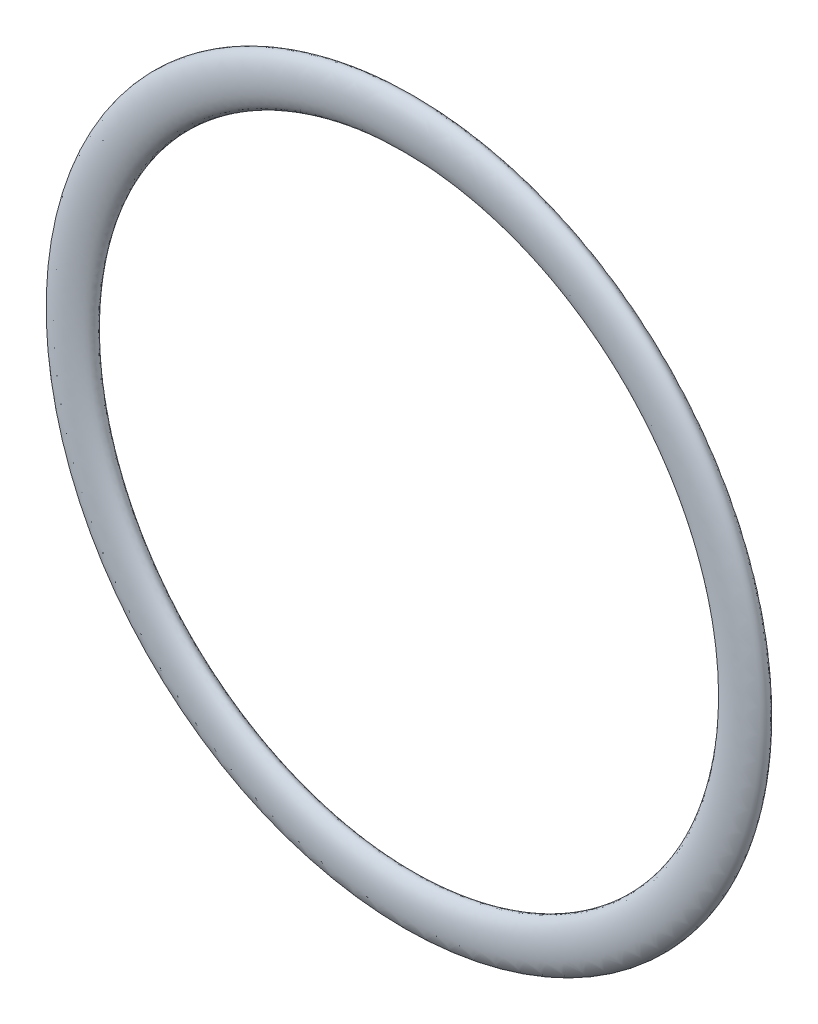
ISO-10303-21;
HEADER;
FILE_DESCRIPTION(('STEP AP214'),'2;1');
FILE_NAME('part.step','',(''),(''),'','','');
FILE_SCHEMA(('AUTOMOTIVE_DESIGN { 1 0 10303 214 1 1 1 1 }'));
ENDSEC;
DATA;
#1=APPLICATION_CONTEXT('core data for automotive mechanical design processes');
#2=APPLICATION_PROTOCOL_DEFINITION('international standard','automotive_design',2000,#1);
#3=PRODUCT_CONTEXT('',#1,'mechanical');
#4=PRODUCT('Part','Part','',(#3));
#5=PRODUCT_RELATED_PRODUCT_CATEGORY('part','',(#4));
#6=PRODUCT_DEFINITION_FORMATION('','',#4);
#7=PRODUCT_DEFINITION_CONTEXT('part definition',#1,'design');
#8=PRODUCT_DEFINITION('design','',#6,#7);
#9=PRODUCT_DEFINITION_SHAPE('','',#8);
#10=(LENGTH_UNIT() NAMED_UNIT(*) SI_UNIT(.MILLI.,.METRE.));
#11=(NAMED_UNIT(*) PLANE_ANGLE_UNIT() SI_UNIT($,.RADIAN.));
#12=(NAMED_UNIT(*) SI_UNIT($,.STERADIAN.) SOLID_ANGLE_UNIT());
#13=UNCERTAINTY_MEASURE_WITH_UNIT(LENGTH_MEASURE(1.E-05),#10,'distance_accuracy_value','');
#14=(GEOMETRIC_REPRESENTATION_CONTEXT(3) GLOBAL_UNCERTAINTY_ASSIGNED_CONTEXT((#13)) GLOBAL_UNIT_ASSIGNED_CONTEXT((#10,
#11,#12)) REPRESENTATION_CONTEXT('',''));
#15=CARTESIAN_POINT('',(0.,0.,0.));
#16=DIRECTION('',(0.,0.,1.));
#17=DIRECTION('',(1.,0.,0.));
#18=AXIS2_PLACEMENT_3D('',#15,#16,#17);
#19=CARTESIAN_POINT('',(0.,24.8,-0.8));
#20=DIRECTION('',(1.,0.,0.));
#21=DIRECTION('',(0.,1.,0.));
#22=AXIS2_PLACEMENT_3D('',#19,#20,#21);
#23=ELLIPSE('',#22,1.8,0.8);
#24=CARTESIAN_POINT('',(0.,0.,0.));
#25=DIRECTION('',(0.,0.,1.));
#26=AXIS1_PLACEMENT('',#24,#25);
#27=SURFACE_OF_REVOLUTION('',#23,#26);
#28=ADVANCED_FACE('F28',(),#27,.T.);
#29=CLOSED_SHELL('',(#28));
#30=MANIFOLD_SOLID_BREP('B2',#29);
#31=ADVANCED_BREP_SHAPE_REPRESENTATION('',(#18,#30),#14);
#32=SHAPE_DEFINITION_REPRESENTATION(#9,#31);
ENDSEC;
END-ISO-10303-21;
